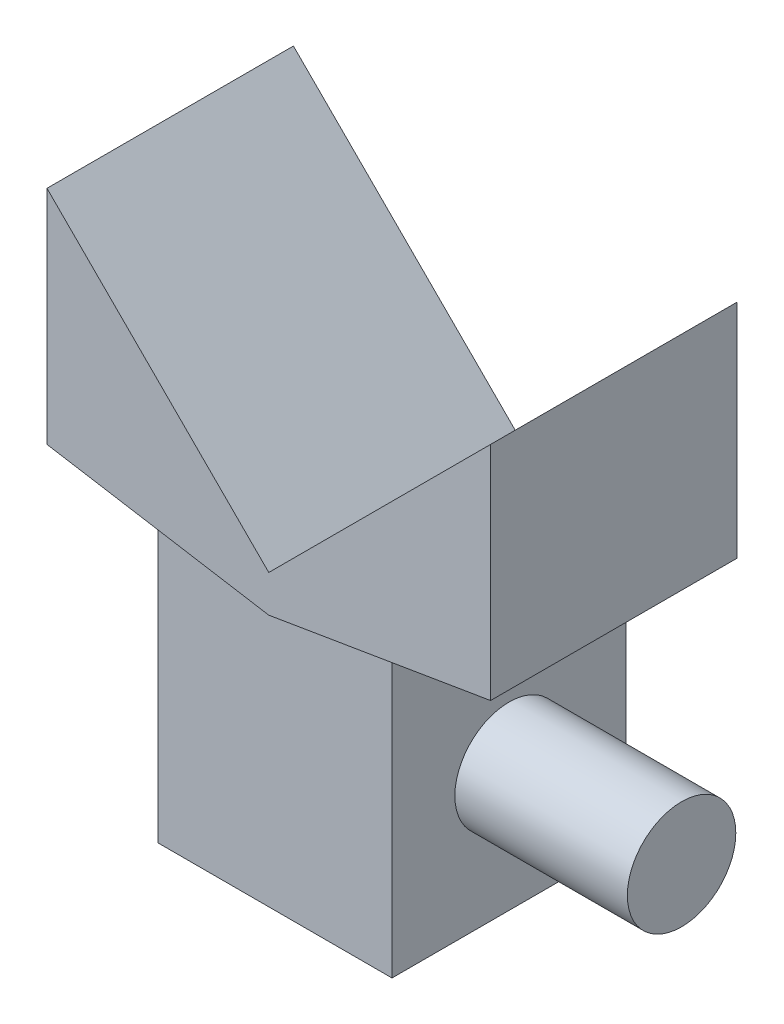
ISO-10303-21;
HEADER;
FILE_DESCRIPTION(('STEP AP214'),'2;1');
FILE_NAME('part.step','',(''),(''),'','','');
FILE_SCHEMA(('AUTOMOTIVE_DESIGN { 1 0 10303 214 1 1 1 1 }'));
ENDSEC;
DATA;
#1=APPLICATION_CONTEXT('core data for automotive mechanical design processes');
#2=APPLICATION_PROTOCOL_DEFINITION('international standard','automotive_design',2000,#1);
#3=PRODUCT_CONTEXT('',#1,'mechanical');
#4=PRODUCT('Part','Part','',(#3));
#5=PRODUCT_RELATED_PRODUCT_CATEGORY('part','',(#4));
#6=PRODUCT_DEFINITION_FORMATION('','',#4);
#7=PRODUCT_DEFINITION_CONTEXT('part definition',#1,'design');
#8=PRODUCT_DEFINITION('design','',#6,#7);
#9=PRODUCT_DEFINITION_SHAPE('','',#8);
#10=(LENGTH_UNIT() NAMED_UNIT(*) SI_UNIT(.MILLI.,.METRE.));
#11=(NAMED_UNIT(*) PLANE_ANGLE_UNIT() SI_UNIT($,.RADIAN.));
#12=(NAMED_UNIT(*) SI_UNIT($,.STERADIAN.) SOLID_ANGLE_UNIT());
#13=UNCERTAINTY_MEASURE_WITH_UNIT(LENGTH_MEASURE(1.E-05),#10,'distance_accuracy_value','');
#14=(GEOMETRIC_REPRESENTATION_CONTEXT(3) GLOBAL_UNCERTAINTY_ASSIGNED_CONTEXT((#13)) GLOBAL_UNIT_ASSIGNED_CONTEXT((#10,
#11,#12)) REPRESENTATION_CONTEXT('',''));
#15=CARTESIAN_POINT('',(0.,0.,0.));
#16=DIRECTION('',(0.,0.,1.));
#17=DIRECTION('',(1.,0.,0.));
#18=AXIS2_PLACEMENT_3D('',#15,#16,#17);
#19=CARTESIAN_POINT('',(-9.,0.,10.));
#20=DIRECTION('',(0.164398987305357,0.986393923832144,0.));
#21=DIRECTION('',(-0.986393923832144,0.164398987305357,0.));
#22=AXIS2_PLACEMENT_3D('',#19,#20,#21);
#23=PLANE('',#22);
#24=DIRECTION('',(-0.986393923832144,0.164398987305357,0.));
#25=VECTOR('',#24,1.);
#26=CARTESIAN_POINT('',(-6.32464864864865,-0.445891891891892,0.250000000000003));
#27=LINE('',#26,#25);
#28=CARTESIAN_POINT('',(0.,-1.5,0.250000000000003));
#29=VERTEX_POINT('',#28);
#30=CARTESIAN_POINT('',(-4.75,-0.708333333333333,0.250000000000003));
#31=VERTEX_POINT('',#30);
#32=EDGE_CURVE('E175',#29,#31,#27,.T.);
#33=ORIENTED_EDGE('',*,*,#32,.T.);
#34=DIRECTION('',(0.,0.,1.));
#35=VECTOR('',#34,1.);
#36=CARTESIAN_POINT('',(-4.75,-0.708333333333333,0.250000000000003));
#37=LINE('',#36,#35);
#38=CARTESIAN_POINT('',(-4.75,-0.708333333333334,9.75));
#39=VERTEX_POINT('',#38);
#40=EDGE_CURVE('E213',#31,#39,#37,.T.);
#41=ORIENTED_EDGE('',*,*,#40,.T.);
#42=DIRECTION('',(0.986393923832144,-0.164398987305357,0.));
#43=VECTOR('',#42,1.);
#44=CARTESIAN_POINT('',(-6.32464864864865,-0.445891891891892,9.75));
#45=LINE('',#44,#43);
#46=CARTESIAN_POINT('',(0.,-1.5,9.75));
#47=VERTEX_POINT('',#46);
#48=EDGE_CURVE('E215',#39,#47,#45,.T.);
#49=ORIENTED_EDGE('',*,*,#48,.T.);
#50=DIRECTION('',(0.,0.,-1.));
#51=VECTOR('',#50,1.);
#52=CARTESIAN_POINT('',(0.,-1.5,10.));
#53=LINE('',#52,#51);
#54=CARTESIAN_POINT('',(0.,-1.5,10.));
#55=VERTEX_POINT('',#54);
#56=EDGE_CURVE('E159',#55,#47,#53,.T.);
#57=ORIENTED_EDGE('',*,*,#56,.F.);
#58=DIRECTION('',(0.986393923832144,-0.164398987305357,0.));
#59=VECTOR('',#58,1.);
#60=CARTESIAN_POINT('',(-9.,0.,10.));
#61=LINE('',#60,#59);
#62=CARTESIAN_POINT('',(-9.,0.,10.));
#63=VERTEX_POINT('',#62);
#64=EDGE_CURVE('E131',#63,#55,#61,.T.);
#65=ORIENTED_EDGE('',*,*,#64,.F.);
#66=DIRECTION('',(0.,0.,-1.));
#67=VECTOR('',#66,1.);
#68=CARTESIAN_POINT('',(-9.,0.,10.));
#69=LINE('',#68,#67);
#70=CARTESIAN_POINT('',(-9.,0.,0.));
#71=VERTEX_POINT('',#70);
#72=EDGE_CURVE('E50',#63,#71,#69,.T.);
#73=ORIENTED_EDGE('',*,*,#72,.T.);
#74=DIRECTION('',(0.986393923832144,-0.164398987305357,0.));
#75=VECTOR('',#74,1.);
#76=CARTESIAN_POINT('',(-9.,0.,0.));
#77=LINE('',#76,#75);
#78=CARTESIAN_POINT('',(0.,-1.5,0.));
#79=VERTEX_POINT('',#78);
#80=EDGE_CURVE('E155',#71,#79,#77,.T.);
#81=ORIENTED_EDGE('',*,*,#80,.T.);
#82=EDGE_CURVE('E124',#29,#79,#53,.T.);
#83=ORIENTED_EDGE('',*,*,#82,.F.);
#84=EDGE_LOOP('',(#33,#41,#49,#57,#65,#73,#81,#83));
#85=FACE_BOUND('',#84,.T.);
#86=ADVANCED_FACE('F42',(#85),#23,.F.);
#87=CARTESIAN_POINT('',(9.,0.,10.));
#88=DIRECTION('',(0.164398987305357,-0.986393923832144,0.));
#89=DIRECTION('',(0.986393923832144,0.164398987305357,0.));
#90=AXIS2_PLACEMENT_3D('',#87,#88,#89);
#91=PLANE('',#90);
#92=DIRECTION('',(0.,0.,1.));
#93=VECTOR('',#92,1.);
#94=CARTESIAN_POINT('',(4.75,-0.708333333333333,0.250000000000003));
#95=LINE('',#94,#93);
#96=CARTESIAN_POINT('',(4.75,-0.708333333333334,0.250000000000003));
#97=VERTEX_POINT('',#96);
#98=CARTESIAN_POINT('',(4.75,-0.708333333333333,9.75));
#99=VERTEX_POINT('',#98);
#100=EDGE_CURVE('E182',#97,#99,#95,.T.);
#101=ORIENTED_EDGE('',*,*,#100,.F.);
#102=DIRECTION('',(0.986393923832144,0.164398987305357,0.));
#103=VECTOR('',#102,1.);
#104=CARTESIAN_POINT('',(-2.91859459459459,-1.98643243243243,0.250000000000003));
#105=LINE('',#104,#103);
#106=EDGE_CURVE('E180',#29,#97,#105,.T.);
#107=ORIENTED_EDGE('',*,*,#106,.F.);
#108=ORIENTED_EDGE('',*,*,#82,.T.);
#109=DIRECTION('',(-0.986393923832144,-0.164398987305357,0.));
#110=VECTOR('',#109,1.);
#111=CARTESIAN_POINT('',(9.,0.,0.));
#112=LINE('',#111,#110);
#113=CARTESIAN_POINT('',(9.,0.,0.));
#114=VERTEX_POINT('',#113);
#115=EDGE_CURVE('E119',#114,#79,#112,.T.);
#116=ORIENTED_EDGE('',*,*,#115,.F.);
#117=DIRECTION('',(0.,0.,-1.));
#118=VECTOR('',#117,1.);
#119=CARTESIAN_POINT('',(9.,0.,10.));
#120=LINE('',#119,#118);
#121=CARTESIAN_POINT('',(9.,0.,10.));
#122=VERTEX_POINT('',#121);
#123=EDGE_CURVE('E112',#122,#114,#120,.T.);
#124=ORIENTED_EDGE('',*,*,#123,.F.);
#125=DIRECTION('',(-0.986393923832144,-0.164398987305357,0.));
#126=VECTOR('',#125,1.);
#127=CARTESIAN_POINT('',(9.,0.,10.));
#128=LINE('',#127,#126);
#129=EDGE_CURVE('E117',#122,#55,#128,.T.);
#130=ORIENTED_EDGE('',*,*,#129,.T.);
#131=ORIENTED_EDGE('',*,*,#56,.T.);
#132=DIRECTION('',(-0.986393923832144,-0.164398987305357,0.));
#133=VECTOR('',#132,1.);
#134=CARTESIAN_POINT('',(-2.91859459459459,-1.98643243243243,9.75));
#135=LINE('',#134,#133);
#136=EDGE_CURVE('E186',#99,#47,#135,.T.);
#137=ORIENTED_EDGE('',*,*,#136,.F.);
#138=EDGE_LOOP('',(#101,#107,#108,#116,#124,#130,#131,#137));
#139=FACE_BOUND('',#138,.T.);
#140=ADVANCED_FACE('F115',(#139),#91,.T.);
#141=CARTESIAN_POINT('',(-9.,0.,10.));
#142=DIRECTION('',(-1.,0.,0.));
#143=DIRECTION('',(0.,0.,1.));
#144=AXIS2_PLACEMENT_3D('',#141,#142,#143);
#145=PLANE('',#144);
#146=DIRECTION('',(0.,1.,0.));
#147=VECTOR('',#146,1.);
#148=CARTESIAN_POINT('',(-9.,0.,0.));
#149=LINE('',#148,#147);
#150=CARTESIAN_POINT('',(-9.,9.,0.));
#151=VERTEX_POINT('',#150);
#152=EDGE_CURVE('E142',#71,#151,#149,.T.);
#153=ORIENTED_EDGE('',*,*,#152,.F.);
#154=ORIENTED_EDGE('',*,*,#72,.F.);
#155=DIRECTION('',(0.,1.,0.));
#156=VECTOR('',#155,1.);
#157=CARTESIAN_POINT('',(-9.,0.,10.));
#158=LINE('',#157,#156);
#159=CARTESIAN_POINT('',(-9.,9.,10.));
#160=VERTEX_POINT('',#159);
#161=EDGE_CURVE('E157',#63,#160,#158,.T.);
#162=ORIENTED_EDGE('',*,*,#161,.T.);
#163=DIRECTION('',(0.,0.,-1.));
#164=VECTOR('',#163,1.);
#165=CARTESIAN_POINT('',(-9.,9.,10.));
#166=LINE('',#165,#164);
#167=EDGE_CURVE('E141',#160,#151,#166,.T.);
#168=ORIENTED_EDGE('',*,*,#167,.T.);
#169=EDGE_LOOP('',(#153,#154,#162,#168));
#170=FACE_BOUND('',#169,.T.);
#171=ADVANCED_FACE('F44',(#170),#145,.T.);
#172=CARTESIAN_POINT('',(9.,9.,10.));
#173=DIRECTION('',(1.,0.,0.));
#174=DIRECTION('',(0.,1.,0.));
#175=AXIS2_PLACEMENT_3D('',#172,#173,#174);
#176=PLANE('',#175);
#177=DIRECTION('',(0.,-1.,0.));
#178=VECTOR('',#177,1.);
#179=CARTESIAN_POINT('',(9.,9.,0.));
#180=LINE('',#179,#178);
#181=CARTESIAN_POINT('',(9.,9.,0.));
#182=VERTEX_POINT('',#181);
#183=EDGE_CURVE('E152',#182,#114,#180,.T.);
#184=ORIENTED_EDGE('',*,*,#183,.F.);
#185=DIRECTION('',(0.,0.,-1.));
#186=VECTOR('',#185,1.);
#187=CARTESIAN_POINT('',(9.,9.,10.));
#188=LINE('',#187,#186);
#189=CARTESIAN_POINT('',(9.,9.,10.));
#190=VERTEX_POINT('',#189);
#191=EDGE_CURVE('E125',#190,#182,#188,.T.);
#192=ORIENTED_EDGE('',*,*,#191,.F.);
#193=DIRECTION('',(0.,-1.,0.));
#194=VECTOR('',#193,1.);
#195=CARTESIAN_POINT('',(9.,9.,10.));
#196=LINE('',#195,#194);
#197=EDGE_CURVE('E129',#190,#122,#196,.T.);
#198=ORIENTED_EDGE('',*,*,#197,.T.);
#199=ORIENTED_EDGE('',*,*,#123,.T.);
#200=EDGE_LOOP('',(#184,#192,#198,#199));
#201=FACE_BOUND('',#200,.T.);
#202=ADVANCED_FACE('F134',(#201),#176,.T.);
#203=CARTESIAN_POINT('',(0.,0.,10.));
#204=DIRECTION('',(-0.707106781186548,0.707106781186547,0.));
#205=DIRECTION('',(-0.707106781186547,-0.707106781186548,0.));
#206=AXIS2_PLACEMENT_3D('',#203,#204,#205);
#207=PLANE('',#206);
#208=DIRECTION('',(0.707106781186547,0.707106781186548,0.));
#209=VECTOR('',#208,1.);
#210=CARTESIAN_POINT('',(0.,0.,0.));
#211=LINE('',#210,#209);
#212=CARTESIAN_POINT('',(0.,0.,0.));
#213=VERTEX_POINT('',#212);
#214=EDGE_CURVE('E149',#213,#182,#211,.T.);
#215=ORIENTED_EDGE('',*,*,#214,.F.);
#216=DIRECTION('',(0.,0.,-1.));
#217=VECTOR('',#216,1.);
#218=CARTESIAN_POINT('',(0.,0.,10.));
#219=LINE('',#218,#217);
#220=CARTESIAN_POINT('',(0.,0.,10.));
#221=VERTEX_POINT('',#220);
#222=EDGE_CURVE('E162',#221,#213,#219,.T.);
#223=ORIENTED_EDGE('',*,*,#222,.F.);
#224=DIRECTION('',(0.707106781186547,0.707106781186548,0.));
#225=VECTOR('',#224,1.);
#226=CARTESIAN_POINT('',(0.,0.,10.));
#227=LINE('',#226,#225);
#228=EDGE_CURVE('E135',#221,#190,#227,.T.);
#229=ORIENTED_EDGE('',*,*,#228,.T.);
#230=ORIENTED_EDGE('',*,*,#191,.T.);
#231=EDGE_LOOP('',(#215,#223,#229,#230));
#232=FACE_BOUND('',#231,.T.);
#233=ADVANCED_FACE('F278',(#232),#207,.T.);
#234=CARTESIAN_POINT('',(0.,0.,10.));
#235=DIRECTION('',(-0.707106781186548,-0.707106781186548,0.));
#236=DIRECTION('',(0.707106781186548,-0.707106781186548,0.));
#237=AXIS2_PLACEMENT_3D('',#234,#235,#236);
#238=PLANE('',#237);
#239=DIRECTION('',(-0.707106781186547,0.707106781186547,0.));
#240=VECTOR('',#239,1.);
#241=CARTESIAN_POINT('',(0.,0.,0.));
#242=LINE('',#241,#240);
#243=EDGE_CURVE('E145',#213,#151,#242,.T.);
#244=ORIENTED_EDGE('',*,*,#243,.T.);
#245=ORIENTED_EDGE('',*,*,#167,.F.);
#246=DIRECTION('',(-0.707106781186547,0.707106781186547,0.));
#247=VECTOR('',#246,1.);
#248=CARTESIAN_POINT('',(0.,0.,10.));
#249=LINE('',#248,#247);
#250=EDGE_CURVE('E99',#221,#160,#249,.T.);
#251=ORIENTED_EDGE('',*,*,#250,.F.);
#252=ORIENTED_EDGE('',*,*,#222,.T.);
#253=EDGE_LOOP('',(#244,#245,#251,#252));
#254=FACE_BOUND('',#253,.T.);
#255=ADVANCED_FACE('F165',(#254),#238,.F.);
#256=CARTESIAN_POINT('',(0.,0.,10.));
#257=DIRECTION('',(0.,0.,1.));
#258=DIRECTION('',(1.,0.,0.));
#259=AXIS2_PLACEMENT_3D('',#256,#257,#258);
#260=PLANE('',#259);
#261=ORIENTED_EDGE('',*,*,#161,.F.);
#262=ORIENTED_EDGE('',*,*,#64,.T.);
#263=ORIENTED_EDGE('',*,*,#129,.F.);
#264=ORIENTED_EDGE('',*,*,#197,.F.);
#265=ORIENTED_EDGE('',*,*,#228,.F.);
#266=ORIENTED_EDGE('',*,*,#250,.T.);
#267=EDGE_LOOP('',(#261,#262,#263,#264,#265,#266));
#268=FACE_BOUND('',#267,.T.);
#269=ADVANCED_FACE('F128',(#268),#260,.T.);
#270=CARTESIAN_POINT('',(0.,0.,0.));
#271=DIRECTION('',(0.,0.,1.));
#272=DIRECTION('',(1.,0.,0.));
#273=AXIS2_PLACEMENT_3D('',#270,#271,#272);
#274=PLANE('',#273);
#275=ORIENTED_EDGE('',*,*,#152,.T.);
#276=ORIENTED_EDGE('',*,*,#243,.F.);
#277=ORIENTED_EDGE('',*,*,#214,.T.);
#278=ORIENTED_EDGE('',*,*,#183,.T.);
#279=ORIENTED_EDGE('',*,*,#115,.T.);
#280=ORIENTED_EDGE('',*,*,#80,.F.);
#281=EDGE_LOOP('',(#275,#276,#277,#278,#279,#280));
#282=FACE_BOUND('',#281,.T.);
#283=ADVANCED_FACE('F168',(#282),#274,.F.);
#284=CARTESIAN_POINT('',(4.75,9.002,0.250000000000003));
#285=DIRECTION('',(-1.,0.,0.));
#286=DIRECTION('',(0.,0.,1.));
#287=AXIS2_PLACEMENT_3D('',#284,#285,#286);
#288=PLANE('',#287);
#289=CARTESIAN_POINT('',(4.75,-6.87763041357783,4.99986321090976));
#290=DIRECTION('',(-1.,0.,0.));
#291=DIRECTION('',(0.,0.,1.));
#292=AXIS2_PLACEMENT_3D('',#289,#290,#291);
#293=CIRCLE('',#292,2.2);
#294=CARTESIAN_POINT('',(4.75,-6.87763041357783,7.19986321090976));
#295=VERTEX_POINT('',#294);
#296=EDGE_CURVE('E11',#295,#295,#293,.F.);
#297=ORIENTED_EDGE('',*,*,#296,.F.);
#298=EDGE_LOOP('',(#297));
#299=FACE_BOUND('',#298,.T.);
#300=DIRECTION('',(0.,-1.,0.));
#301=VECTOR('',#300,1.);
#302=CARTESIAN_POINT('',(4.75,9.002,0.250000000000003));
#303=LINE('',#302,#301);
#304=CARTESIAN_POINT('',(4.75,-12.,0.250000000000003));
#305=VERTEX_POINT('',#304);
#306=EDGE_CURVE('E188',#97,#305,#303,.T.);
#307=ORIENTED_EDGE('',*,*,#306,.F.);
#308=ORIENTED_EDGE('',*,*,#100,.T.);
#309=DIRECTION('',(0.,-1.,0.));
#310=VECTOR('',#309,1.);
#311=CARTESIAN_POINT('',(4.75,9.002,9.75));
#312=LINE('',#311,#310);
#313=CARTESIAN_POINT('',(4.75,-12.,9.75));
#314=VERTEX_POINT('',#313);
#315=EDGE_CURVE('E57',#99,#314,#312,.T.);
#316=ORIENTED_EDGE('',*,*,#315,.T.);
#317=DIRECTION('',(0.,0.,-1.));
#318=VECTOR('',#317,1.);
#319=CARTESIAN_POINT('',(4.75,-12.,0.250000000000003));
#320=LINE('',#319,#318);
#321=EDGE_CURVE('E146',#314,#305,#320,.T.);
#322=ORIENTED_EDGE('',*,*,#321,.T.);
#323=EDGE_LOOP('',(#307,#308,#316,#322));
#324=FACE_BOUND('',#323,.T.);
#325=ADVANCED_FACE('F230',(#299,#324),#288,.F.);
#326=CARTESIAN_POINT('',(-4.75,9.002,0.250000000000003));
#327=DIRECTION('',(1.,0.,0.));
#328=DIRECTION('',(0.,0.,-1.));
#329=AXIS2_PLACEMENT_3D('',#326,#327,#328);
#330=PLANE('',#329);
#331=ORIENTED_EDGE('',*,*,#40,.F.);
#332=DIRECTION('',(0.,-1.,0.));
#333=VECTOR('',#332,1.);
#334=CARTESIAN_POINT('',(-4.75,9.002,0.250000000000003));
#335=LINE('',#334,#333);
#336=CARTESIAN_POINT('',(-4.75,-12.,0.250000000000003));
#337=VERTEX_POINT('',#336);
#338=EDGE_CURVE('E205',#31,#337,#335,.T.);
#339=ORIENTED_EDGE('',*,*,#338,.T.);
#340=DIRECTION('',(0.,0.,1.));
#341=VECTOR('',#340,1.);
#342=CARTESIAN_POINT('',(-4.75,-12.,0.250000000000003));
#343=LINE('',#342,#341);
#344=CARTESIAN_POINT('',(-4.75,-12.,9.75));
#345=VERTEX_POINT('',#344);
#346=EDGE_CURVE('E200',#337,#345,#343,.T.);
#347=ORIENTED_EDGE('',*,*,#346,.T.);
#348=DIRECTION('',(0.,-1.,0.));
#349=VECTOR('',#348,1.);
#350=CARTESIAN_POINT('',(-4.75,9.002,9.75));
#351=LINE('',#350,#349);
#352=EDGE_CURVE('E208',#39,#345,#351,.T.);
#353=ORIENTED_EDGE('',*,*,#352,.F.);
#354=EDGE_LOOP('',(#331,#339,#347,#353));
#355=FACE_BOUND('',#354,.T.);
#356=ADVANCED_FACE('F235',(#355),#330,.F.);
#357=CARTESIAN_POINT('',(-4.75,9.002,0.250000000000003));
#358=DIRECTION('',(0.,0.,1.));
#359=DIRECTION('',(1.,0.,0.));
#360=AXIS2_PLACEMENT_3D('',#357,#358,#359);
#361=PLANE('',#360);
#362=ORIENTED_EDGE('',*,*,#32,.F.);
#363=ORIENTED_EDGE('',*,*,#106,.T.);
#364=ORIENTED_EDGE('',*,*,#306,.T.);
#365=DIRECTION('',(-1.,0.,0.));
#366=VECTOR('',#365,1.);
#367=CARTESIAN_POINT('',(-4.75,-12.,0.250000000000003));
#368=LINE('',#367,#366);
#369=EDGE_CURVE('E197',#305,#337,#368,.T.);
#370=ORIENTED_EDGE('',*,*,#369,.T.);
#371=ORIENTED_EDGE('',*,*,#338,.F.);
#372=EDGE_LOOP('',(#362,#363,#364,#370,#371));
#373=FACE_BOUND('',#372,.T.);
#374=ADVANCED_FACE('F241',(#373),#361,.F.);
#375=CARTESIAN_POINT('',(-4.75,9.002,9.75));
#376=DIRECTION('',(0.,0.,-1.));
#377=DIRECTION('',(-1.,0.,0.));
#378=AXIS2_PLACEMENT_3D('',#375,#376,#377);
#379=PLANE('',#378);
#380=ORIENTED_EDGE('',*,*,#315,.F.);
#381=ORIENTED_EDGE('',*,*,#136,.T.);
#382=ORIENTED_EDGE('',*,*,#48,.F.);
#383=ORIENTED_EDGE('',*,*,#352,.T.);
#384=DIRECTION('',(1.,0.,0.));
#385=VECTOR('',#384,1.);
#386=CARTESIAN_POINT('',(-4.75,-12.,9.75));
#387=LINE('',#386,#385);
#388=EDGE_CURVE('E196',#345,#314,#387,.T.);
#389=ORIENTED_EDGE('',*,*,#388,.T.);
#390=EDGE_LOOP('',(#380,#381,#382,#383,#389));
#391=FACE_BOUND('',#390,.T.);
#392=ADVANCED_FACE('F257',(#391),#379,.F.);
#393=CARTESIAN_POINT('',(0.,-12.,0.));
#394=DIRECTION('',(0.,1.,0.));
#395=DIRECTION('',(0.,0.,1.));
#396=AXIS2_PLACEMENT_3D('',#393,#394,#395);
#397=PLANE('',#396);
#398=ORIENTED_EDGE('',*,*,#321,.F.);
#399=ORIENTED_EDGE('',*,*,#388,.F.);
#400=ORIENTED_EDGE('',*,*,#346,.F.);
#401=ORIENTED_EDGE('',*,*,#369,.F.);
#402=EDGE_LOOP('',(#398,#399,#400,#401));
#403=FACE_BOUND('',#402,.T.);
#404=ADVANCED_FACE('F228',(#403),#397,.F.);
#405=CARTESIAN_POINT('',(11.75,-6.87763041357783,4.99986321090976));
#406=DIRECTION('',(-1.,0.,0.));
#407=DIRECTION('',(0.,0.,1.));
#408=AXIS2_PLACEMENT_3D('',#405,#406,#407);
#409=CYLINDRICAL_SURFACE('',#408,2.2);
#410=CARTESIAN_POINT('',(11.75,-6.87763041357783,4.99986321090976));
#411=DIRECTION('',(1.,0.,0.));
#412=DIRECTION('',(0.,0.,-1.));
#413=AXIS2_PLACEMENT_3D('',#410,#411,#412);
#414=CIRCLE('',#413,2.2);
#415=CARTESIAN_POINT('',(11.75,-6.87763041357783,2.79986321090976));
#416=VERTEX_POINT('',#415);
#417=EDGE_CURVE('E192',#416,#416,#414,.T.);
#418=ORIENTED_EDGE('',*,*,#417,.F.);
#419=EDGE_LOOP('',(#418));
#420=FACE_BOUND('',#419,.T.);
#421=ORIENTED_EDGE('',*,*,#296,.T.);
#422=EDGE_LOOP('',(#421));
#423=FACE_BOUND('',#422,.T.);
#424=ADVANCED_FACE('F225',(#420,#423),#409,.T.);
#425=CARTESIAN_POINT('',(11.75,-6.87763041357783,4.99986321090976));
#426=DIRECTION('',(1.,0.,0.));
#427=DIRECTION('',(0.,0.,-1.));
#428=AXIS2_PLACEMENT_3D('',#425,#426,#427);
#429=PLANE('',#428);
#430=ORIENTED_EDGE('',*,*,#417,.T.);
#431=EDGE_LOOP('',(#430));
#432=FACE_BOUND('',#431,.T.);
#433=ADVANCED_FACE('F223',(#432),#429,.T.);
#434=CLOSED_SHELL('',(#86,#140,#171,#202,#233,#255,#269,#283,#325,#356,#374,#392,#404,#424,#433));
#435=MANIFOLD_SOLID_BREP('B2',#434);
#436=ADVANCED_BREP_SHAPE_REPRESENTATION('',(#18,#435),#14);
#437=SHAPE_DEFINITION_REPRESENTATION(#9,#436);
ENDSEC;
END-ISO-10303-21;
